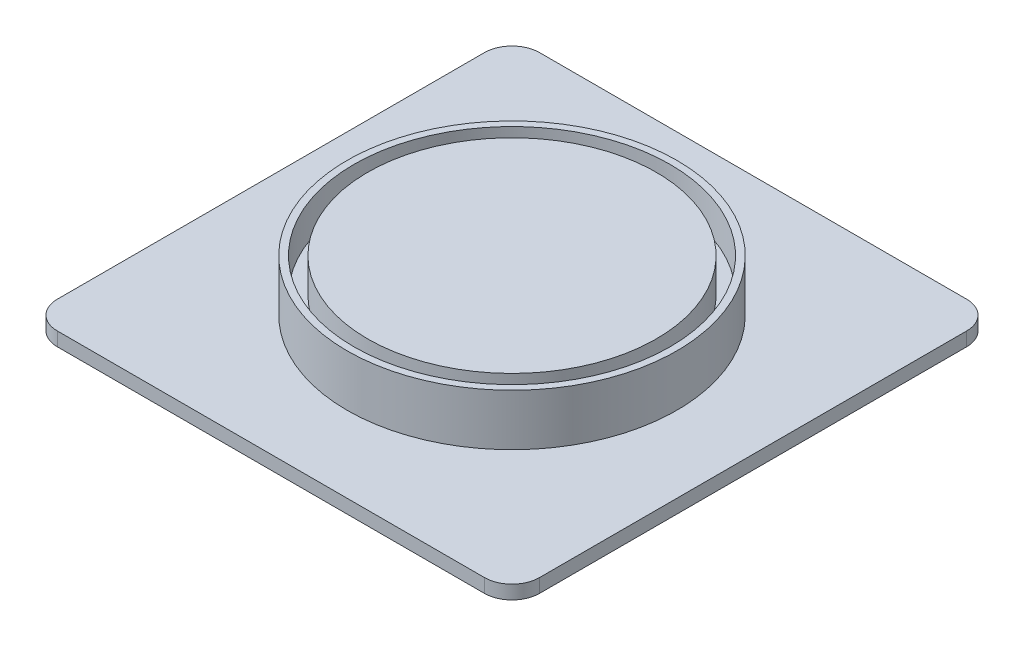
from build123d import *

# Parameters (mm, degrees)
SKETCH1_R      = 120
EXTRUDE1_DEPTH = 37.4682
SKETCH2_W      = 350.8
SKETCH2_H      = 350.8
EXTRUDE2_DEPTH = 10
FILLET1_R      = 20
SKETCH3_R      = 115
SKETCH3_R_2    = 105
EXTRUDE3_DEPTH = 25


with BuildPart() as part:
    # Sketch1 → Extrude1 (new body)
    with BuildSketch(Plane(origin=(0, 0, 0), x_dir=(1, 0, 0), z_dir=(0, 1, 0))):
        with Locations(Location((0, 0, 0), (0, 0, 270))):
            Circle(SKETCH1_R)
    extrude(amount=EXTRUDE1_DEPTH)

    # Sketch2 → Extrude2 (add)
    with BuildSketch(Plane(origin=(0, 0, 0), x_dir=(1, 0, 0), z_dir=(0, 1, 0))):
        Rectangle(SKETCH2_W, SKETCH2_H)
    extrude(amount=-EXTRUDE2_DEPTH)

    # Fillet1
    fillet1_edges = [part.edges().sort_by_distance(p)[0] for p in [
        (175.4, -5, -175.4),
        (175.4, -5, 175.4),
        (-175.4, -5, 175.4),
        (-175.4, -5, -175.4),
    ]]
    fillet(fillet1_edges, radius=FILLET1_R)

    # Sketch3 → Extrude3 (cut)
    with BuildSketch(Plane(origin=(0, 37.4682, 0), x_dir=(1, 0, 0), z_dir=(0, 1, 0))):
        with Locations(Location((0, 0, 0), (0, 0, 270))):
            Circle(SKETCH3_R)
        with Locations(Location((0, 0, 0), (0, 0, 270))):
            Circle(SKETCH3_R_2, mode=Mode.SUBTRACT)
    extrude(amount=-EXTRUDE3_DEPTH, mode=Mode.SUBTRACT)


solid = part.part
